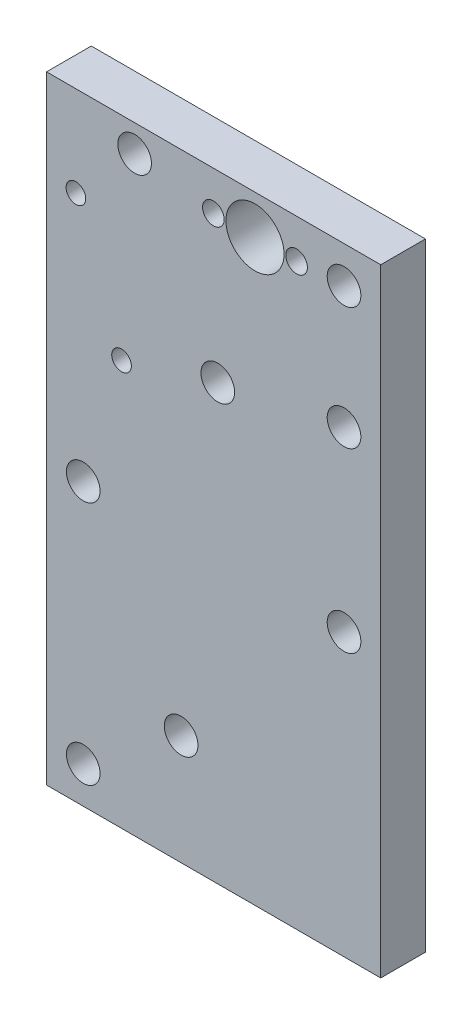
ISO-10303-21;
HEADER;
FILE_DESCRIPTION(('STEP AP214'),'2;1');
FILE_NAME('part.step','',(''),(''),'','','');
FILE_SCHEMA(('AUTOMOTIVE_DESIGN { 1 0 10303 214 1 1 1 1 }'));
ENDSEC;
DATA;
#1=APPLICATION_CONTEXT('core data for automotive mechanical design processes');
#2=APPLICATION_PROTOCOL_DEFINITION('international standard','automotive_design',2000,#1);
#3=PRODUCT_CONTEXT('',#1,'mechanical');
#4=PRODUCT('Part','Part','',(#3));
#5=PRODUCT_RELATED_PRODUCT_CATEGORY('part','',(#4));
#6=PRODUCT_DEFINITION_FORMATION('','',#4);
#7=PRODUCT_DEFINITION_CONTEXT('part definition',#1,'design');
#8=PRODUCT_DEFINITION('design','',#6,#7);
#9=PRODUCT_DEFINITION_SHAPE('','',#8);
#10=(LENGTH_UNIT() NAMED_UNIT(*) SI_UNIT(.MILLI.,.METRE.));
#11=(NAMED_UNIT(*) PLANE_ANGLE_UNIT() SI_UNIT($,.RADIAN.));
#12=(NAMED_UNIT(*) SI_UNIT($,.STERADIAN.) SOLID_ANGLE_UNIT());
#13=UNCERTAINTY_MEASURE_WITH_UNIT(LENGTH_MEASURE(1.E-05),#10,'distance_accuracy_value','');
#14=(GEOMETRIC_REPRESENTATION_CONTEXT(3) GLOBAL_UNCERTAINTY_ASSIGNED_CONTEXT((#13)) GLOBAL_UNIT_ASSIGNED_CONTEXT((#10,
#11,#12)) REPRESENTATION_CONTEXT('',''));
#15=CARTESIAN_POINT('',(0.,0.,0.));
#16=DIRECTION('',(0.,0.,1.));
#17=DIRECTION('',(1.,0.,0.));
#18=AXIS2_PLACEMENT_3D('',#15,#16,#17);
#19=CARTESIAN_POINT('',(-542.036,24.13,11.6082064));
#20=DIRECTION('',(1.,0.,0.));
#21=DIRECTION('',(0.,0.,-1.));
#22=AXIS2_PLACEMENT_3D('',#19,#20,#21);
#23=PLANE('',#22);
#24=DIRECTION('',(0.,-1.,0.));
#25=VECTOR('',#24,1.);
#26=CARTESIAN_POINT('',(-542.036,24.13,0.));
#27=LINE('',#26,#25);
#28=CARTESIAN_POINT('',(-542.036,24.13,0.));
#29=VERTEX_POINT('',#28);
#30=CARTESIAN_POINT('',(-542.036,-136.2075,0.));
#31=VERTEX_POINT('',#30);
#32=EDGE_CURVE('E126',#29,#31,#27,.T.);
#33=ORIENTED_EDGE('',*,*,#32,.T.);
#34=DIRECTION('',(0.,0.,-1.));
#35=VECTOR('',#34,1.);
#36=CARTESIAN_POINT('',(-542.036,-136.2075,11.6082064));
#37=LINE('',#36,#35);
#38=CARTESIAN_POINT('',(-542.036,-136.2075,11.6082064));
#39=VERTEX_POINT('',#38);
#40=EDGE_CURVE('E12',#39,#31,#37,.T.);
#41=ORIENTED_EDGE('',*,*,#40,.F.);
#42=DIRECTION('',(0.,-1.,0.));
#43=VECTOR('',#42,1.);
#44=CARTESIAN_POINT('',(-542.036,24.13,11.6082064));
#45=LINE('',#44,#43);
#46=CARTESIAN_POINT('',(-542.036,24.13,11.6082064));
#47=VERTEX_POINT('',#46);
#48=EDGE_CURVE('E108',#47,#39,#45,.T.);
#49=ORIENTED_EDGE('',*,*,#48,.F.);
#50=DIRECTION('',(0.,0.,-1.));
#51=VECTOR('',#50,1.);
#52=CARTESIAN_POINT('',(-542.036,24.13,11.6082064));
#53=LINE('',#52,#51);
#54=EDGE_CURVE('E121',#47,#29,#53,.T.);
#55=ORIENTED_EDGE('',*,*,#54,.T.);
#56=EDGE_LOOP('',(#33,#41,#49,#55));
#57=FACE_BOUND('',#56,.T.);
#58=ADVANCED_FACE('F56',(#57),#23,.F.);
#59=CARTESIAN_POINT('',(-542.036,-136.2075,11.6082064));
#60=DIRECTION('',(0.,1.,0.));
#61=DIRECTION('',(0.,0.,1.));
#62=AXIS2_PLACEMENT_3D('',#59,#60,#61);
#63=PLANE('',#62);
#64=DIRECTION('',(1.,0.,0.));
#65=VECTOR('',#64,1.);
#66=CARTESIAN_POINT('',(-542.036,-136.2075,0.));
#67=LINE('',#66,#65);
#68=CARTESIAN_POINT('',(-455.295,-136.2075,0.));
#69=VERTEX_POINT('',#68);
#70=EDGE_CURVE('E113',#31,#69,#67,.T.);
#71=ORIENTED_EDGE('',*,*,#70,.T.);
#72=DIRECTION('',(0.,0.,-1.));
#73=VECTOR('',#72,1.);
#74=CARTESIAN_POINT('',(-455.295,-136.2075,11.6082064));
#75=LINE('',#74,#73);
#76=CARTESIAN_POINT('',(-455.295,-136.2075,11.6082064));
#77=VERTEX_POINT('',#76);
#78=EDGE_CURVE('E65',#77,#69,#75,.T.);
#79=ORIENTED_EDGE('',*,*,#78,.F.);
#80=DIRECTION('',(1.,0.,0.));
#81=VECTOR('',#80,1.);
#82=CARTESIAN_POINT('',(-542.036,-136.2075,11.6082064));
#83=LINE('',#82,#81);
#84=EDGE_CURVE('E103',#39,#77,#83,.T.);
#85=ORIENTED_EDGE('',*,*,#84,.F.);
#86=ORIENTED_EDGE('',*,*,#40,.T.);
#87=EDGE_LOOP('',(#71,#79,#85,#86));
#88=FACE_BOUND('',#87,.T.);
#89=ADVANCED_FACE('F112',(#88),#63,.F.);
#90=CARTESIAN_POINT('',(-455.295,24.13,11.6082064));
#91=DIRECTION('',(-1.,0.,0.));
#92=DIRECTION('',(0.,0.,1.));
#93=AXIS2_PLACEMENT_3D('',#90,#91,#92);
#94=PLANE('',#93);
#95=DIRECTION('',(0.,1.,0.));
#96=VECTOR('',#95,1.);
#97=CARTESIAN_POINT('',(-455.295,24.13,0.));
#98=LINE('',#97,#96);
#99=CARTESIAN_POINT('',(-455.295,24.13,0.));
#100=VERTEX_POINT('',#99);
#101=EDGE_CURVE('E90',#69,#100,#98,.T.);
#102=ORIENTED_EDGE('',*,*,#101,.T.);
#103=DIRECTION('',(0.,0.,-1.));
#104=VECTOR('',#103,1.);
#105=CARTESIAN_POINT('',(-455.295,24.13,11.6082064));
#106=LINE('',#105,#104);
#107=CARTESIAN_POINT('',(-455.295,24.13,11.6082064));
#108=VERTEX_POINT('',#107);
#109=EDGE_CURVE('E115',#108,#100,#106,.T.);
#110=ORIENTED_EDGE('',*,*,#109,.F.);
#111=DIRECTION('',(0.,1.,0.));
#112=VECTOR('',#111,1.);
#113=CARTESIAN_POINT('',(-455.295,24.13,11.6082064));
#114=LINE('',#113,#112);
#115=EDGE_CURVE('E106',#77,#108,#114,.T.);
#116=ORIENTED_EDGE('',*,*,#115,.F.);
#117=ORIENTED_EDGE('',*,*,#78,.T.);
#118=EDGE_LOOP('',(#102,#110,#116,#117));
#119=FACE_BOUND('',#118,.T.);
#120=ADVANCED_FACE('F116',(#119),#94,.F.);
#121=CARTESIAN_POINT('',(-542.036,24.13,11.6082064));
#122=DIRECTION('',(0.,-1.,0.));
#123=DIRECTION('',(0.,0.,-1.));
#124=AXIS2_PLACEMENT_3D('',#121,#122,#123);
#125=PLANE('',#124);
#126=DIRECTION('',(-1.,0.,0.));
#127=VECTOR('',#126,1.);
#128=CARTESIAN_POINT('',(-542.036,24.13,0.));
#129=LINE('',#128,#127);
#130=EDGE_CURVE('E96',#100,#29,#129,.T.);
#131=ORIENTED_EDGE('',*,*,#130,.T.);
#132=ORIENTED_EDGE('',*,*,#54,.F.);
#133=DIRECTION('',(-1.,0.,0.));
#134=VECTOR('',#133,1.);
#135=CARTESIAN_POINT('',(-542.036,24.13,11.6082064));
#136=LINE('',#135,#134);
#137=EDGE_CURVE('E73',#108,#47,#136,.T.);
#138=ORIENTED_EDGE('',*,*,#137,.F.);
#139=ORIENTED_EDGE('',*,*,#109,.T.);
#140=EDGE_LOOP('',(#131,#132,#138,#139));
#141=FACE_BOUND('',#140,.T.);
#142=ADVANCED_FACE('F203',(#141),#125,.F.);
#143=CARTESIAN_POINT('',(0.,0.,11.6082064));
#144=DIRECTION('',(0.,0.,1.));
#145=DIRECTION('',(1.,0.,0.));
#146=AXIS2_PLACEMENT_3D('',#143,#144,#145);
#147=PLANE('',#146);
#148=CARTESIAN_POINT('',(-532.511,-126.6825,11.6082064));
#149=DIRECTION('',(0.,0.,1.));
#150=DIRECTION('',(1.,0.,0.));
#151=AXIS2_PLACEMENT_3D('',#148,#149,#150);
#152=CIRCLE('',#151,4.36879999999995);
#153=CARTESIAN_POINT('',(-528.1422,-126.6825,11.6082064));
#154=VERTEX_POINT('',#153);
#155=EDGE_CURVE('E272',#154,#154,#152,.T.);
#156=ORIENTED_EDGE('',*,*,#155,.F.);
#157=EDGE_LOOP('',(#156));
#158=FACE_BOUND('',#157,.T.);
#159=CARTESIAN_POINT('',(-507.111,-107.6325,11.6082064));
#160=DIRECTION('',(0.,0.,1.));
#161=DIRECTION('',(1.,0.,0.));
#162=AXIS2_PLACEMENT_3D('',#159,#160,#161);
#163=CIRCLE('',#162,4.36879999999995);
#164=CARTESIAN_POINT('',(-502.7422,-107.6325,11.6082064));
#165=VERTEX_POINT('',#164);
#166=EDGE_CURVE('E280',#165,#165,#163,.T.);
#167=ORIENTED_EDGE('',*,*,#166,.F.);
#168=EDGE_LOOP('',(#167));
#169=FACE_BOUND('',#168,.T.);
#170=CARTESIAN_POINT('',(-464.82,14.605,11.6082064));
#171=DIRECTION('',(0.,0.,1.));
#172=DIRECTION('',(1.,0.,0.));
#173=AXIS2_PLACEMENT_3D('',#170,#171,#172);
#174=CIRCLE('',#173,4.36880000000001);
#175=CARTESIAN_POINT('',(-460.4512,14.605,11.6082064));
#176=VERTEX_POINT('',#175);
#177=EDGE_CURVE('E295',#176,#176,#174,.T.);
#178=ORIENTED_EDGE('',*,*,#177,.F.);
#179=EDGE_LOOP('',(#178));
#180=FACE_BOUND('',#179,.T.);
#181=CARTESIAN_POINT('',(-519.176,17.145,11.6082064));
#182=DIRECTION('',(0.,0.,1.));
#183=DIRECTION('',(1.,0.,0.));
#184=AXIS2_PLACEMENT_3D('',#181,#182,#183);
#185=CIRCLE('',#184,4.36879999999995);
#186=CARTESIAN_POINT('',(-514.8072,17.145,11.6082064));
#187=VERTEX_POINT('',#186);
#188=EDGE_CURVE('E307',#187,#187,#185,.T.);
#189=ORIENTED_EDGE('',*,*,#188,.F.);
#190=EDGE_LOOP('',(#189));
#191=FACE_BOUND('',#190,.T.);
#192=CARTESIAN_POINT('',(-532.511,-63.1825,11.6082064));
#193=DIRECTION('',(0.,0.,1.));
#194=DIRECTION('',(1.,0.,0.));
#195=AXIS2_PLACEMENT_3D('',#192,#193,#194);
#196=CIRCLE('',#195,4.36879999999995);
#197=CARTESIAN_POINT('',(-528.1422,-63.1825,11.6082064));
#198=VERTEX_POINT('',#197);
#199=EDGE_CURVE('E315',#198,#198,#196,.T.);
#200=ORIENTED_EDGE('',*,*,#199,.F.);
#201=EDGE_LOOP('',(#200));
#202=FACE_BOUND('',#201,.T.);
#203=CARTESIAN_POINT('',(-497.586,-23.495,11.6082064));
#204=DIRECTION('',(0.,0.,1.));
#205=DIRECTION('',(1.,0.,0.));
#206=AXIS2_PLACEMENT_3D('',#203,#204,#205);
#207=CIRCLE('',#206,4.36880000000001);
#208=CARTESIAN_POINT('',(-493.2172,-23.495,11.6082064));
#209=VERTEX_POINT('',#208);
#210=EDGE_CURVE('E327',#209,#209,#207,.T.);
#211=ORIENTED_EDGE('',*,*,#210,.F.);
#212=EDGE_LOOP('',(#211));
#213=FACE_BOUND('',#212,.T.);
#214=CARTESIAN_POINT('',(-464.82,-63.1825,11.6082064));
#215=DIRECTION('',(0.,0.,1.));
#216=DIRECTION('',(1.,0.,0.));
#217=AXIS2_PLACEMENT_3D('',#214,#215,#216);
#218=CIRCLE('',#217,4.36880000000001);
#219=CARTESIAN_POINT('',(-460.4512,-63.1825,11.6082064));
#220=VERTEX_POINT('',#219);
#221=EDGE_CURVE('E335',#220,#220,#218,.T.);
#222=ORIENTED_EDGE('',*,*,#221,.F.);
#223=EDGE_LOOP('',(#222));
#224=FACE_BOUND('',#223,.T.);
#225=CARTESIAN_POINT('',(-464.82,-17.145,11.6082064));
#226=DIRECTION('',(0.,0.,1.));
#227=DIRECTION('',(1.,0.,0.));
#228=AXIS2_PLACEMENT_3D('',#225,#226,#227);
#229=CIRCLE('',#228,4.36880000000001);
#230=CARTESIAN_POINT('',(-460.4512,-17.145,11.6082064));
#231=VERTEX_POINT('',#230);
#232=EDGE_CURVE('E346',#231,#231,#229,.T.);
#233=ORIENTED_EDGE('',*,*,#232,.F.);
#234=EDGE_LOOP('',(#233));
#235=FACE_BOUND('',#234,.T.);
#236=CARTESIAN_POINT('',(-498.729,13.97,11.6082064));
#237=DIRECTION('',(0.,0.,1.));
#238=DIRECTION('',(1.,0.,0.));
#239=AXIS2_PLACEMENT_3D('',#236,#237,#238);
#240=CIRCLE('',#239,2.8067);
#241=CARTESIAN_POINT('',(-495.9223,13.97,11.6082064));
#242=VERTEX_POINT('',#241);
#243=EDGE_CURVE('E354',#242,#242,#240,.T.);
#244=ORIENTED_EDGE('',*,*,#243,.F.);
#245=EDGE_LOOP('',(#244));
#246=FACE_BOUND('',#245,.T.);
#247=CARTESIAN_POINT('',(-477.139,13.97,11.6082064));
#248=DIRECTION('',(0.,0.,1.));
#249=DIRECTION('',(1.,0.,0.));
#250=AXIS2_PLACEMENT_3D('',#247,#248,#249);
#251=CIRCLE('',#250,2.8067);
#252=CARTESIAN_POINT('',(-474.3323,13.97,11.6082064));
#253=VERTEX_POINT('',#252);
#254=EDGE_CURVE('E366',#253,#253,#251,.T.);
#255=ORIENTED_EDGE('',*,*,#254,.F.);
#256=EDGE_LOOP('',(#255));
#257=FACE_BOUND('',#256,.T.);
#258=CARTESIAN_POINT('',(-487.934,13.97,11.6082064));
#259=DIRECTION('',(0.,0.,1.));
#260=DIRECTION('',(1.,0.,0.));
#261=AXIS2_PLACEMENT_3D('',#258,#259,#260);
#262=CIRCLE('',#261,7.54062500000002);
#263=CARTESIAN_POINT('',(-480.393375,13.97,11.6082064));
#264=VERTEX_POINT('',#263);
#265=EDGE_CURVE('E158',#264,#264,#262,.T.);
#266=ORIENTED_EDGE('',*,*,#265,.F.);
#267=EDGE_LOOP('',(#266));
#268=FACE_BOUND('',#267,.T.);
#269=CARTESIAN_POINT('',(-534.416,0.687159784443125,11.6082064));
#270=DIRECTION('',(0.,0.,-1.));
#271=DIRECTION('',(-1.,0.,0.));
#272=AXIS2_PLACEMENT_3D('',#269,#270,#271);
#273=CIRCLE('',#272,2.55269999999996);
#274=CARTESIAN_POINT('',(-536.9687,0.687159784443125,11.6082064));
#275=VERTEX_POINT('',#274);
#276=EDGE_CURVE('E152',#275,#275,#273,.T.);
#277=ORIENTED_EDGE('',*,*,#276,.T.);
#278=EDGE_LOOP('',(#277));
#279=FACE_BOUND('',#278,.T.);
#280=CARTESIAN_POINT('',(-522.572795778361,-31.0085922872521,11.6082064));
#281=DIRECTION('',(0.,0.,-1.));
#282=DIRECTION('',(-1.,0.,0.));
#283=AXIS2_PLACEMENT_3D('',#280,#281,#282);
#284=CIRCLE('',#283,2.55269999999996);
#285=CARTESIAN_POINT('',(-525.125495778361,-31.0085922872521,11.6082064));
#286=VERTEX_POINT('',#285);
#287=EDGE_CURVE('E143',#286,#286,#284,.T.);
#288=ORIENTED_EDGE('',*,*,#287,.T.);
#289=EDGE_LOOP('',(#288));
#290=FACE_BOUND('',#289,.T.);
#291=ORIENTED_EDGE('',*,*,#48,.T.);
#292=ORIENTED_EDGE('',*,*,#84,.T.);
#293=ORIENTED_EDGE('',*,*,#115,.T.);
#294=ORIENTED_EDGE('',*,*,#137,.T.);
#295=EDGE_LOOP('',(#291,#292,#293,#294));
#296=FACE_BOUND('',#295,.T.);
#297=ADVANCED_FACE('F104',(#158,#169,#180,#191,#202,#213,#224,#235,#246,#257,#268,#279,#290,
#296),#147,.T.);
#298=CARTESIAN_POINT('',(0.,0.,0.));
#299=DIRECTION('',(0.,0.,1.));
#300=DIRECTION('',(1.,0.,0.));
#301=AXIS2_PLACEMENT_3D('',#298,#299,#300);
#302=PLANE('',#301);
#303=CARTESIAN_POINT('',(-532.511,-126.6825,0.));
#304=DIRECTION('',(0.,0.,1.));
#305=DIRECTION('',(1.,0.,0.));
#306=AXIS2_PLACEMENT_3D('',#303,#304,#305);
#307=CIRCLE('',#306,4.36879999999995);
#308=CARTESIAN_POINT('',(-528.1422,-126.6825,0.));
#309=VERTEX_POINT('',#308);
#310=EDGE_CURVE('E269',#309,#309,#307,.T.);
#311=ORIENTED_EDGE('',*,*,#310,.T.);
#312=EDGE_LOOP('',(#311));
#313=FACE_BOUND('',#312,.T.);
#314=CARTESIAN_POINT('',(-507.111,-107.6325,0.));
#315=DIRECTION('',(0.,0.,1.));
#316=DIRECTION('',(1.,0.,0.));
#317=AXIS2_PLACEMENT_3D('',#314,#315,#316);
#318=CIRCLE('',#317,4.36879999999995);
#319=CARTESIAN_POINT('',(-502.7422,-107.6325,0.));
#320=VERTEX_POINT('',#319);
#321=EDGE_CURVE('E274',#320,#320,#318,.T.);
#322=ORIENTED_EDGE('',*,*,#321,.T.);
#323=EDGE_LOOP('',(#322));
#324=FACE_BOUND('',#323,.T.);
#325=CARTESIAN_POINT('',(-464.82,14.605,0.));
#326=DIRECTION('',(0.,0.,1.));
#327=DIRECTION('',(1.,0.,0.));
#328=AXIS2_PLACEMENT_3D('',#325,#326,#327);
#329=CIRCLE('',#328,4.36880000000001);
#330=CARTESIAN_POINT('',(-460.4512,14.605,0.));
#331=VERTEX_POINT('',#330);
#332=EDGE_CURVE('E301',#331,#331,#329,.T.);
#333=ORIENTED_EDGE('',*,*,#332,.T.);
#334=EDGE_LOOP('',(#333));
#335=FACE_BOUND('',#334,.T.);
#336=CARTESIAN_POINT('',(-519.176,17.145,0.));
#337=DIRECTION('',(0.,0.,1.));
#338=DIRECTION('',(1.,0.,0.));
#339=AXIS2_PLACEMENT_3D('',#336,#337,#338);
#340=CIRCLE('',#339,4.36879999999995);
#341=CARTESIAN_POINT('',(-514.8072,17.145,0.));
#342=VERTEX_POINT('',#341);
#343=EDGE_CURVE('E300',#342,#342,#340,.T.);
#344=ORIENTED_EDGE('',*,*,#343,.T.);
#345=EDGE_LOOP('',(#344));
#346=FACE_BOUND('',#345,.T.);
#347=CARTESIAN_POINT('',(-532.511,-63.1825,0.));
#348=DIRECTION('',(0.,0.,1.));
#349=DIRECTION('',(1.,0.,0.));
#350=AXIS2_PLACEMENT_3D('',#347,#348,#349);
#351=CIRCLE('',#350,4.36879999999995);
#352=CARTESIAN_POINT('',(-528.1422,-63.1825,0.));
#353=VERTEX_POINT('',#352);
#354=EDGE_CURVE('E321',#353,#353,#351,.T.);
#355=ORIENTED_EDGE('',*,*,#354,.T.);
#356=EDGE_LOOP('',(#355));
#357=FACE_BOUND('',#356,.T.);
#358=CARTESIAN_POINT('',(-497.586,-23.495,0.));
#359=DIRECTION('',(0.,0.,1.));
#360=DIRECTION('',(1.,0.,0.));
#361=AXIS2_PLACEMENT_3D('',#358,#359,#360);
#362=CIRCLE('',#361,4.36880000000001);
#363=CARTESIAN_POINT('',(-493.2172,-23.495,0.));
#364=VERTEX_POINT('',#363);
#365=EDGE_CURVE('E320',#364,#364,#362,.T.);
#366=ORIENTED_EDGE('',*,*,#365,.T.);
#367=EDGE_LOOP('',(#366));
#368=FACE_BOUND('',#367,.T.);
#369=CARTESIAN_POINT('',(-464.82,-63.1825,0.));
#370=DIRECTION('',(0.,0.,1.));
#371=DIRECTION('',(1.,0.,0.));
#372=AXIS2_PLACEMENT_3D('',#369,#370,#371);
#373=CIRCLE('',#372,4.36880000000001);
#374=CARTESIAN_POINT('',(-460.4512,-63.1825,0.));
#375=VERTEX_POINT('',#374);
#376=EDGE_CURVE('E341',#375,#375,#373,.T.);
#377=ORIENTED_EDGE('',*,*,#376,.T.);
#378=EDGE_LOOP('',(#377));
#379=FACE_BOUND('',#378,.T.);
#380=CARTESIAN_POINT('',(-464.82,-17.145,0.));
#381=DIRECTION('',(0.,0.,1.));
#382=DIRECTION('',(1.,0.,0.));
#383=AXIS2_PLACEMENT_3D('',#380,#381,#382);
#384=CIRCLE('',#383,4.36880000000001);
#385=CARTESIAN_POINT('',(-460.4512,-17.145,0.));
#386=VERTEX_POINT('',#385);
#387=EDGE_CURVE('E340',#386,#386,#384,.T.);
#388=ORIENTED_EDGE('',*,*,#387,.T.);
#389=EDGE_LOOP('',(#388));
#390=FACE_BOUND('',#389,.T.);
#391=CARTESIAN_POINT('',(-498.729,13.97,0.));
#392=DIRECTION('',(0.,0.,1.));
#393=DIRECTION('',(1.,0.,0.));
#394=AXIS2_PLACEMENT_3D('',#391,#392,#393);
#395=CIRCLE('',#394,2.8067);
#396=CARTESIAN_POINT('',(-495.9223,13.97,0.));
#397=VERTEX_POINT('',#396);
#398=EDGE_CURVE('E360',#397,#397,#395,.T.);
#399=ORIENTED_EDGE('',*,*,#398,.T.);
#400=EDGE_LOOP('',(#399));
#401=FACE_BOUND('',#400,.T.);
#402=CARTESIAN_POINT('',(-477.139,13.97,0.));
#403=DIRECTION('',(0.,0.,1.));
#404=DIRECTION('',(1.,0.,0.));
#405=AXIS2_PLACEMENT_3D('',#402,#403,#404);
#406=CIRCLE('',#405,2.8067);
#407=CARTESIAN_POINT('',(-474.3323,13.97,0.));
#408=VERTEX_POINT('',#407);
#409=EDGE_CURVE('E359',#408,#408,#406,.T.);
#410=ORIENTED_EDGE('',*,*,#409,.T.);
#411=EDGE_LOOP('',(#410));
#412=FACE_BOUND('',#411,.T.);
#413=CARTESIAN_POINT('',(-487.934,13.97,0.));
#414=DIRECTION('',(0.,0.,1.));
#415=DIRECTION('',(1.,0.,0.));
#416=AXIS2_PLACEMENT_3D('',#413,#414,#415);
#417=CIRCLE('',#416,7.54062500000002);
#418=CARTESIAN_POINT('',(-480.393375,13.97,0.));
#419=VERTEX_POINT('',#418);
#420=EDGE_CURVE('E370',#419,#419,#417,.T.);
#421=ORIENTED_EDGE('',*,*,#420,.T.);
#422=EDGE_LOOP('',(#421));
#423=FACE_BOUND('',#422,.T.);
#424=CARTESIAN_POINT('',(-534.416,0.687159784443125,0.));
#425=DIRECTION('',(0.,0.,-1.));
#426=DIRECTION('',(-1.,0.,0.));
#427=AXIS2_PLACEMENT_3D('',#424,#425,#426);
#428=CIRCLE('',#427,2.55269999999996);
#429=CARTESIAN_POINT('',(-536.9687,0.687159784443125,0.));
#430=VERTEX_POINT('',#429);
#431=EDGE_CURVE('E157',#430,#430,#428,.T.);
#432=ORIENTED_EDGE('',*,*,#431,.F.);
#433=EDGE_LOOP('',(#432));
#434=FACE_BOUND('',#433,.T.);
#435=CARTESIAN_POINT('',(-522.572795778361,-31.0085922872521,0.));
#436=DIRECTION('',(0.,0.,-1.));
#437=DIRECTION('',(-1.,0.,0.));
#438=AXIS2_PLACEMENT_3D('',#435,#436,#437);
#439=CIRCLE('',#438,2.55269999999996);
#440=CARTESIAN_POINT('',(-525.125495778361,-31.0085922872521,0.));
#441=VERTEX_POINT('',#440);
#442=EDGE_CURVE('E139',#441,#441,#439,.T.);
#443=ORIENTED_EDGE('',*,*,#442,.F.);
#444=EDGE_LOOP('',(#443));
#445=FACE_BOUND('',#444,.T.);
#446=ORIENTED_EDGE('',*,*,#32,.F.);
#447=ORIENTED_EDGE('',*,*,#130,.F.);
#448=ORIENTED_EDGE('',*,*,#101,.F.);
#449=ORIENTED_EDGE('',*,*,#70,.F.);
#450=EDGE_LOOP('',(#446,#447,#448,#449));
#451=FACE_BOUND('',#450,.T.);
#452=ADVANCED_FACE('F179',(#313,#324,#335,#346,#357,#368,#379,#390,#401,#412,#423,#434,#445,
#451),#302,.F.);
#453=CARTESIAN_POINT('',(-522.572795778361,-31.0085922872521,0.));
#454=DIRECTION('',(0.,0.,-1.));
#455=DIRECTION('',(-1.,0.,0.));
#456=AXIS2_PLACEMENT_3D('',#453,#454,#455);
#457=CYLINDRICAL_SURFACE('',#456,2.55269999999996);
#458=ORIENTED_EDGE('',*,*,#287,.F.);
#459=EDGE_LOOP('',(#458));
#460=FACE_BOUND('',#459,.T.);
#461=ORIENTED_EDGE('',*,*,#442,.T.);
#462=EDGE_LOOP('',(#461));
#463=FACE_BOUND('',#462,.T.);
#464=ADVANCED_FACE('F175',(#460,#463),#457,.F.);
#465=CARTESIAN_POINT('',(-534.416,0.687159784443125,0.));
#466=DIRECTION('',(0.,0.,-1.));
#467=DIRECTION('',(-1.,0.,0.));
#468=AXIS2_PLACEMENT_3D('',#465,#466,#467);
#469=CYLINDRICAL_SURFACE('',#468,2.55269999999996);
#470=ORIENTED_EDGE('',*,*,#276,.F.);
#471=EDGE_LOOP('',(#470));
#472=FACE_BOUND('',#471,.T.);
#473=ORIENTED_EDGE('',*,*,#431,.T.);
#474=EDGE_LOOP('',(#473));
#475=FACE_BOUND('',#474,.T.);
#476=ADVANCED_FACE('F178',(#472,#475),#469,.F.);
#477=CARTESIAN_POINT('',(-487.934,13.97,11.6082064));
#478=DIRECTION('',(0.,0.,1.));
#479=DIRECTION('',(1.,0.,0.));
#480=AXIS2_PLACEMENT_3D('',#477,#478,#479);
#481=CYLINDRICAL_SURFACE('',#480,7.54062500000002);
#482=ORIENTED_EDGE('',*,*,#420,.F.);
#483=EDGE_LOOP('',(#482));
#484=FACE_BOUND('',#483,.T.);
#485=ORIENTED_EDGE('',*,*,#265,.T.);
#486=EDGE_LOOP('',(#485));
#487=FACE_BOUND('',#486,.T.);
#488=ADVANCED_FACE('F220',(#484,#487),#481,.F.);
#489=CARTESIAN_POINT('',(-477.139,13.97,11.6082064));
#490=DIRECTION('',(0.,0.,1.));
#491=DIRECTION('',(1.,0.,0.));
#492=AXIS2_PLACEMENT_3D('',#489,#490,#491);
#493=CYLINDRICAL_SURFACE('',#492,2.8067);
#494=ORIENTED_EDGE('',*,*,#409,.F.);
#495=EDGE_LOOP('',(#494));
#496=FACE_BOUND('',#495,.T.);
#497=ORIENTED_EDGE('',*,*,#254,.T.);
#498=EDGE_LOOP('',(#497));
#499=FACE_BOUND('',#498,.T.);
#500=ADVANCED_FACE('F224',(#496,#499),#493,.F.);
#501=CARTESIAN_POINT('',(-498.729,13.97,11.6082064));
#502=DIRECTION('',(0.,0.,1.));
#503=DIRECTION('',(1.,0.,0.));
#504=AXIS2_PLACEMENT_3D('',#501,#502,#503);
#505=CYLINDRICAL_SURFACE('',#504,2.8067);
#506=ORIENTED_EDGE('',*,*,#398,.F.);
#507=EDGE_LOOP('',(#506));
#508=FACE_BOUND('',#507,.T.);
#509=ORIENTED_EDGE('',*,*,#243,.T.);
#510=EDGE_LOOP('',(#509));
#511=FACE_BOUND('',#510,.T.);
#512=ADVANCED_FACE('F228',(#508,#511),#505,.F.);
#513=CARTESIAN_POINT('',(-464.82,-17.145,11.6082064));
#514=DIRECTION('',(0.,0.,1.));
#515=DIRECTION('',(1.,0.,0.));
#516=AXIS2_PLACEMENT_3D('',#513,#514,#515);
#517=CYLINDRICAL_SURFACE('',#516,4.36880000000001);
#518=ORIENTED_EDGE('',*,*,#387,.F.);
#519=EDGE_LOOP('',(#518));
#520=FACE_BOUND('',#519,.T.);
#521=ORIENTED_EDGE('',*,*,#232,.T.);
#522=EDGE_LOOP('',(#521));
#523=FACE_BOUND('',#522,.T.);
#524=ADVANCED_FACE('F232',(#520,#523),#517,.F.);
#525=CARTESIAN_POINT('',(-464.82,-63.1825,11.6082064));
#526=DIRECTION('',(0.,0.,1.));
#527=DIRECTION('',(1.,0.,0.));
#528=AXIS2_PLACEMENT_3D('',#525,#526,#527);
#529=CYLINDRICAL_SURFACE('',#528,4.36880000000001);
#530=ORIENTED_EDGE('',*,*,#376,.F.);
#531=EDGE_LOOP('',(#530));
#532=FACE_BOUND('',#531,.T.);
#533=ORIENTED_EDGE('',*,*,#221,.T.);
#534=EDGE_LOOP('',(#533));
#535=FACE_BOUND('',#534,.T.);
#536=ADVANCED_FACE('F236',(#532,#535),#529,.F.);
#537=CARTESIAN_POINT('',(-497.586,-23.495,11.6082064));
#538=DIRECTION('',(0.,0.,1.));
#539=DIRECTION('',(1.,0.,0.));
#540=AXIS2_PLACEMENT_3D('',#537,#538,#539);
#541=CYLINDRICAL_SURFACE('',#540,4.36880000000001);
#542=ORIENTED_EDGE('',*,*,#365,.F.);
#543=EDGE_LOOP('',(#542));
#544=FACE_BOUND('',#543,.T.);
#545=ORIENTED_EDGE('',*,*,#210,.T.);
#546=EDGE_LOOP('',(#545));
#547=FACE_BOUND('',#546,.T.);
#548=ADVANCED_FACE('F240',(#544,#547),#541,.F.);
#549=CARTESIAN_POINT('',(-532.511,-63.1825,11.6082064));
#550=DIRECTION('',(0.,0.,1.));
#551=DIRECTION('',(1.,0.,0.));
#552=AXIS2_PLACEMENT_3D('',#549,#550,#551);
#553=CYLINDRICAL_SURFACE('',#552,4.36879999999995);
#554=ORIENTED_EDGE('',*,*,#354,.F.);
#555=EDGE_LOOP('',(#554));
#556=FACE_BOUND('',#555,.T.);
#557=ORIENTED_EDGE('',*,*,#199,.T.);
#558=EDGE_LOOP('',(#557));
#559=FACE_BOUND('',#558,.T.);
#560=ADVANCED_FACE('F244',(#556,#559),#553,.F.);
#561=CARTESIAN_POINT('',(-519.176,17.145,11.6082064));
#562=DIRECTION('',(0.,0.,1.));
#563=DIRECTION('',(1.,0.,0.));
#564=AXIS2_PLACEMENT_3D('',#561,#562,#563);
#565=CYLINDRICAL_SURFACE('',#564,4.36879999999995);
#566=ORIENTED_EDGE('',*,*,#343,.F.);
#567=EDGE_LOOP('',(#566));
#568=FACE_BOUND('',#567,.T.);
#569=ORIENTED_EDGE('',*,*,#188,.T.);
#570=EDGE_LOOP('',(#569));
#571=FACE_BOUND('',#570,.T.);
#572=ADVANCED_FACE('F248',(#568,#571),#565,.F.);
#573=CARTESIAN_POINT('',(-464.82,14.605,11.6082064));
#574=DIRECTION('',(0.,0.,1.));
#575=DIRECTION('',(1.,0.,0.));
#576=AXIS2_PLACEMENT_3D('',#573,#574,#575);
#577=CYLINDRICAL_SURFACE('',#576,4.36880000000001);
#578=ORIENTED_EDGE('',*,*,#332,.F.);
#579=EDGE_LOOP('',(#578));
#580=FACE_BOUND('',#579,.T.);
#581=ORIENTED_EDGE('',*,*,#177,.T.);
#582=EDGE_LOOP('',(#581));
#583=FACE_BOUND('',#582,.T.);
#584=ADVANCED_FACE('F252',(#580,#583),#577,.F.);
#585=CARTESIAN_POINT('',(-507.111,-107.6325,11.6082064));
#586=DIRECTION('',(0.,0.,1.));
#587=DIRECTION('',(1.,0.,0.));
#588=AXIS2_PLACEMENT_3D('',#585,#586,#587);
#589=CYLINDRICAL_SURFACE('',#588,4.36879999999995);
#590=ORIENTED_EDGE('',*,*,#321,.F.);
#591=EDGE_LOOP('',(#590));
#592=FACE_BOUND('',#591,.T.);
#593=ORIENTED_EDGE('',*,*,#166,.T.);
#594=EDGE_LOOP('',(#593));
#595=FACE_BOUND('',#594,.T.);
#596=ADVANCED_FACE('F256',(#592,#595),#589,.F.);
#597=CARTESIAN_POINT('',(-532.511,-126.6825,11.6082064));
#598=DIRECTION('',(0.,0.,1.));
#599=DIRECTION('',(1.,0.,0.));
#600=AXIS2_PLACEMENT_3D('',#597,#598,#599);
#601=CYLINDRICAL_SURFACE('',#600,4.36879999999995);
#602=ORIENTED_EDGE('',*,*,#310,.F.);
#603=EDGE_LOOP('',(#602));
#604=FACE_BOUND('',#603,.T.);
#605=ORIENTED_EDGE('',*,*,#155,.T.);
#606=EDGE_LOOP('',(#605));
#607=FACE_BOUND('',#606,.T.);
#608=ADVANCED_FACE('F260',(#604,#607),#601,.F.);
#609=CLOSED_SHELL('',(#58,#89,#120,#142,#297,#452,#464,#476,#488,#500,#512,#524,#536,#548,#560,
#572,#584,#596,#608));
#610=MANIFOLD_SOLID_BREP('B2',#609);
#611=ADVANCED_BREP_SHAPE_REPRESENTATION('',(#18,#610),#14);
#612=SHAPE_DEFINITION_REPRESENTATION(#9,#611);
ENDSEC;
END-ISO-10303-21;
